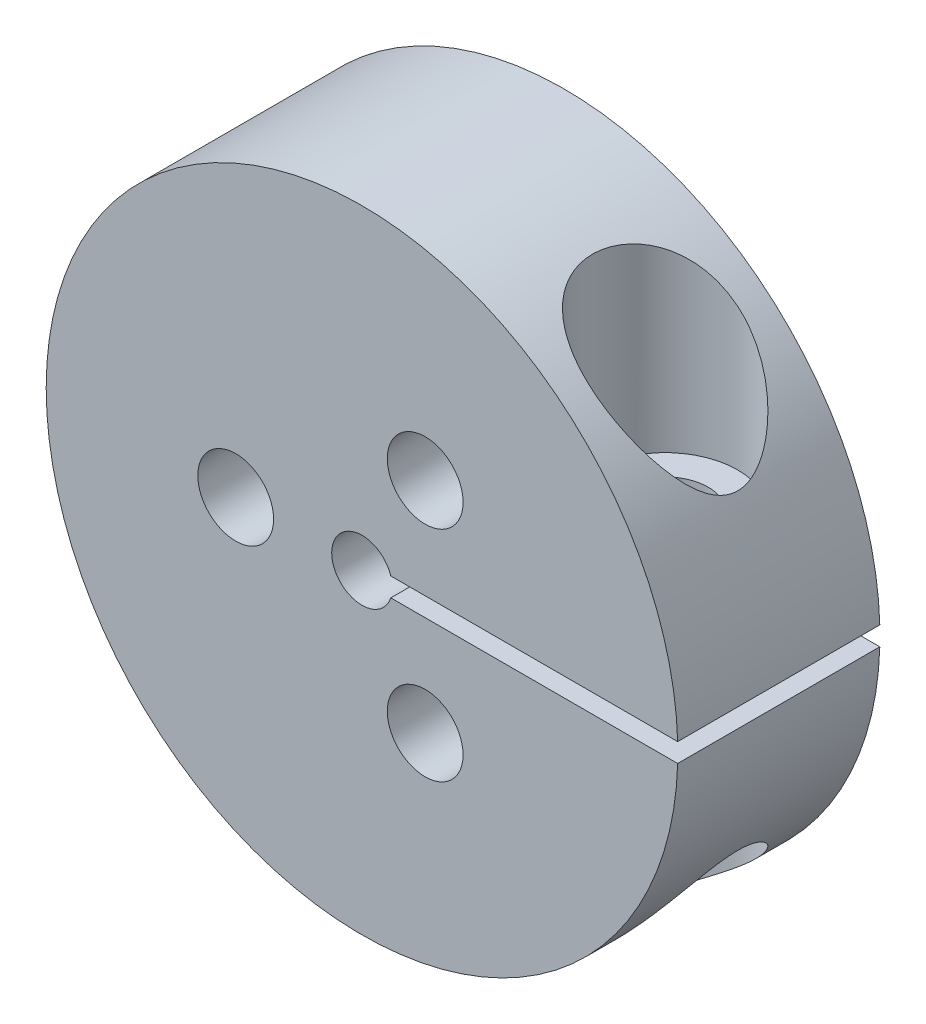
from build123d import *

# Parameters (mm, degrees)
SKETCH1_R               = 1.5
BOSS_EXTRUDE1_DEPTH     = 4
CUT_EXTRUDE1_DEPTH      = 19.12456896
CUT_EXTRUDE1_DEPTH_BACK = 19.12456896
SKETCH2_R               = 1.55
SKETCH3_R               = 2.875
CUT_EXTRUDE2_DEPTH      = 22.083168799
CUT_EXTRUDE3_REACH      = 23.083
SKETCH4_R               = 1.7


with BuildPart() as part:
    # Sketch1 → Boss-Extrude1 (new, symmetric)
    with BuildSketch(Plane.XY):
        with BuildLine():
            Line((12.494373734, -0.375), (1.139901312, -0.375))
            ThreePointArc((1.139901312, -0.375), (-1.2, 0), (1.139901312, 0.375))
            Line((1.139901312, 0.375), (12.494373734, 0.375))
            ThreePointArc((12.494373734, 0.375), (-12.5, 0), (12.494373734, -0.375))
        make_face()
        with Locations((2.5, -4.330127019)):
            Circle(SKETCH1_R, mode=Mode.SUBTRACT)
        with Locations((-5, 0)):
            Circle(SKETCH1_R, mode=Mode.SUBTRACT)
        with Locations((2.5, 4.330127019)):
            Circle(SKETCH1_R, mode=Mode.SUBTRACT)
    extrude(amount=BOSS_EXTRUDE1_DEPTH, both=True)

    # Sketch2 → Cut-Extrude1 (cut, two sides: drawn at the far end of the back side and taken through both)
    with BuildSketch(Plane(origin=(0, 0, 0), x_dir=(1, 0, 0), z_dir=(0, 1, 0)).offset(-CUT_EXTRUDE1_DEPTH_BACK)):
        with Locations(Location((8, 0, 0), (0, 0, 270))):
            Circle(SKETCH2_R)
    extrude(amount=CUT_EXTRUDE1_DEPTH + CUT_EXTRUDE1_DEPTH_BACK, mode=Mode.SUBTRACT)

    # Sketch3 → Cut-Extrude2 (cut, through all)
    with BuildSketch(Plane(origin=(0, 4, 0), x_dir=(1, 0, 0), z_dir=(0, 1, 0))):
        with Locations(Location((8, 0, 0), (0, 0, 90))):
            Circle(SKETCH3_R)
    cut_extrude2 = extrude(amount=CUT_EXTRUDE2_DEPTH, mode=Mode.SUBTRACT)

    # Mirror1: Cut-Extrude2 across plane
    add(cut_extrude2.mirror(Plane.ZX), mode=Mode.SUBTRACT)

    # Sketch4 → Cut-Extrude3 (cut, up to next)
    with BuildSketch(Plane(origin=(0, 4, 0), x_dir=(1, 0, 0), z_dir=(0, 1, 0)), mode=Mode.PRIVATE) as cut_extrude3_sk1:
        with Locations(Location((8, 0, 0), (0, 0, 270))):
            Circle(SKETCH4_R)
    cut_extrude3_tool1 = extrude(cut_extrude3_sk1.sketch, amount=-CUT_EXTRUDE3_REACH, mode=Mode.PRIVATE) & part.part
    add(cut_extrude3_tool1.solids().sort_by_distance((8, 4, 0))[0], mode=Mode.SUBTRACT)


solid = part.part
